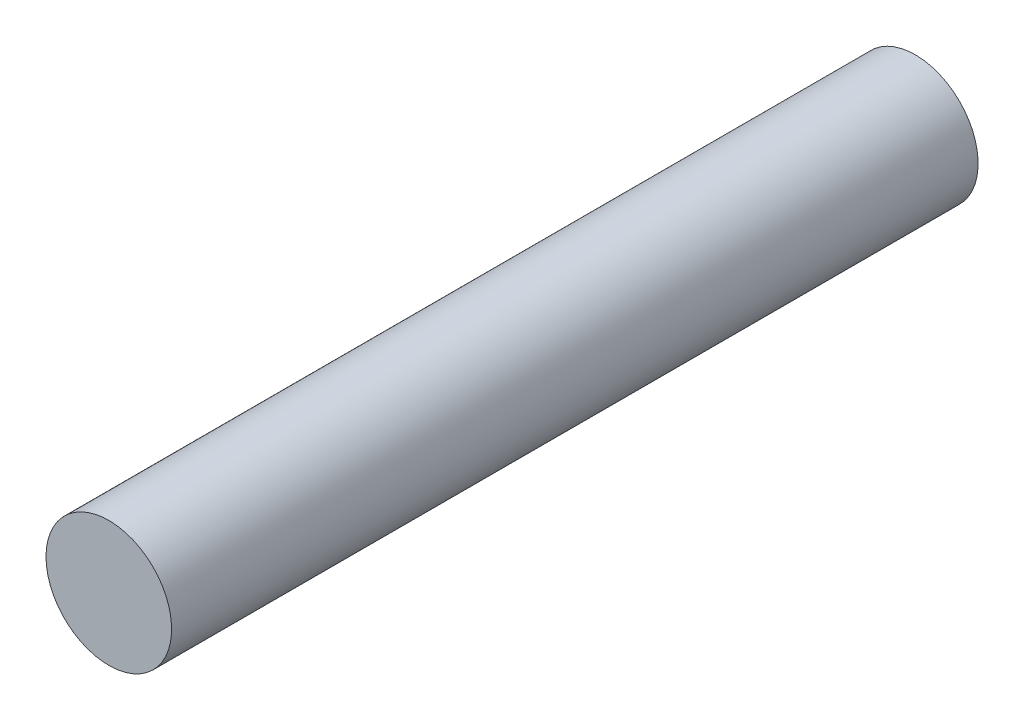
from build123d import *

# Parameters (mm, degrees)
ESQUISSE1_R      = 9.5
EXTRUSION1_DEPTH = 122


with BuildPart() as part:
    # Esquisse1 → Extrusion1 (new body)
    with BuildSketch(Plane.XY):
        with Locations(Location((0, 0, 0), (0, 0, 180))):
            Circle(ESQUISSE1_R)
    extrude(amount=EXTRUSION1_DEPTH)


solid = part.part
